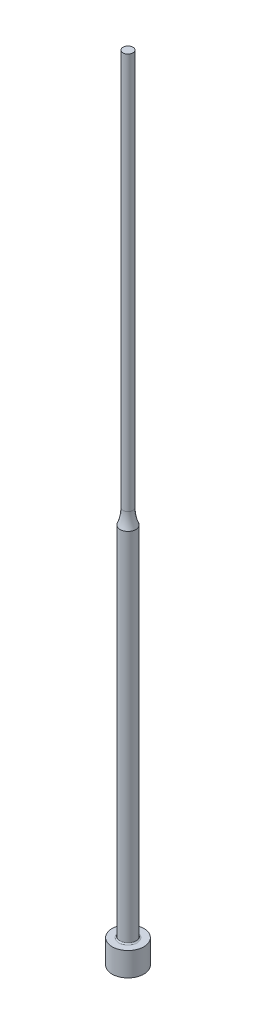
ISO-10303-21;
HEADER;
FILE_DESCRIPTION(('STEP AP214'),'2;1');
FILE_NAME('part.step','',(''),(''),'','','');
FILE_SCHEMA(('AUTOMOTIVE_DESIGN { 1 0 10303 214 1 1 1 1 }'));
ENDSEC;
DATA;
#1=APPLICATION_CONTEXT('core data for automotive mechanical design processes');
#2=APPLICATION_PROTOCOL_DEFINITION('international standard','automotive_design',2000,#1);
#3=PRODUCT_CONTEXT('',#1,'mechanical');
#4=PRODUCT('Part','Part','',(#3));
#5=PRODUCT_RELATED_PRODUCT_CATEGORY('part','',(#4));
#6=PRODUCT_DEFINITION_FORMATION('','',#4);
#7=PRODUCT_DEFINITION_CONTEXT('part definition',#1,'design');
#8=PRODUCT_DEFINITION('design','',#6,#7);
#9=PRODUCT_DEFINITION_SHAPE('','',#8);
#10=(LENGTH_UNIT() NAMED_UNIT(*) SI_UNIT(.MILLI.,.METRE.));
#11=(NAMED_UNIT(*) PLANE_ANGLE_UNIT() SI_UNIT($,.RADIAN.));
#12=(NAMED_UNIT(*) SI_UNIT($,.STERADIAN.) SOLID_ANGLE_UNIT());
#13=UNCERTAINTY_MEASURE_WITH_UNIT(LENGTH_MEASURE(1.E-05),#10,'distance_accuracy_value','');
#14=(GEOMETRIC_REPRESENTATION_CONTEXT(3) GLOBAL_UNCERTAINTY_ASSIGNED_CONTEXT((#13)) GLOBAL_UNIT_ASSIGNED_CONTEXT((#10,
#11,#12)) REPRESENTATION_CONTEXT('',''));
#15=CARTESIAN_POINT('',(0.,0.,0.));
#16=DIRECTION('',(0.,0.,1.));
#17=DIRECTION('',(1.,0.,0.));
#18=AXIS2_PLACEMENT_3D('',#15,#16,#17);
#19=CARTESIAN_POINT('',(1.25000000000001,200.,0.));
#20=DIRECTION('',(0.,-1.,0.));
#21=DIRECTION('',(1.,0.,0.));
#22=AXIS2_PLACEMENT_3D('',#19,#20,#21);
#23=PLANE('',#22);
#24=CARTESIAN_POINT('',(0.,200.,0.));
#25=DIRECTION('',(0.,1.,0.));
#26=DIRECTION('',(-1.,0.,0.));
#27=AXIS2_PLACEMENT_3D('',#24,#25,#26);
#28=CIRCLE('',#27,1.25000000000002);
#29=CARTESIAN_POINT('',(-1.25000000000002,200.,0.));
#30=VERTEX_POINT('',#29);
#31=EDGE_CURVE('E10',#30,#30,#28,.T.);
#32=ORIENTED_EDGE('',*,*,#31,.T.);
#33=EDGE_LOOP('',(#32));
#34=FACE_BOUND('',#33,.T.);
#35=ADVANCED_FACE('F30',(#34),#23,.F.);
#36=CARTESIAN_POINT('',(0.,200.,0.));
#37=DIRECTION('',(0.,1.,0.));
#38=DIRECTION('',(-1.,0.,0.));
#39=AXIS2_PLACEMENT_3D('',#36,#37,#38);
#40=CYLINDRICAL_SURFACE('',#39,1.25000000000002);
#41=ORIENTED_EDGE('',*,*,#31,.F.);
#42=EDGE_LOOP('',(#41));
#43=FACE_BOUND('',#42,.T.);
#44=CARTESIAN_POINT('',(0.,100.,0.));
#45=DIRECTION('',(0.,1.,0.));
#46=DIRECTION('',(-1.,0.,0.));
#47=AXIS2_PLACEMENT_3D('',#44,#45,#46);
#48=CIRCLE('',#47,1.25000000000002);
#49=CARTESIAN_POINT('',(-1.25000000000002,100.,0.));
#50=VERTEX_POINT('',#49);
#51=EDGE_CURVE('E36',#50,#50,#48,.T.);
#52=ORIENTED_EDGE('',*,*,#51,.T.);
#53=EDGE_LOOP('',(#52));
#54=FACE_BOUND('',#53,.T.);
#55=ADVANCED_FACE('F71',(#43,#54),#40,.T.);
#56=CARTESIAN_POINT('',(0.,100.,0.));
#57=DIRECTION('',(0.,1.,0.));
#58=DIRECTION('',(-1.,0.,0.));
#59=AXIS2_PLACEMENT_3D('',#56,#57,#58);
#60=TOROIDAL_SURFACE('',#59,11.25,10.);
#61=ORIENTED_EDGE('',*,*,#51,.F.);
#62=EDGE_LOOP('',(#61));
#63=FACE_BOUND('',#62,.T.);
#64=CARTESIAN_POINT('',(0.,96.2003289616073,0.));
#65=DIRECTION('',(0.,1.,0.));
#66=DIRECTION('',(-1.,0.,0.));
#67=AXIS2_PLACEMENT_3D('',#64,#65,#66);
#68=CIRCLE('',#67,2.00000000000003);
#69=CARTESIAN_POINT('',(-2.00000000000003,96.2003289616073,0.));
#70=VERTEX_POINT('',#69);
#71=EDGE_CURVE('E40',#70,#70,#68,.T.);
#72=ORIENTED_EDGE('',*,*,#71,.T.);
#73=EDGE_LOOP('',(#72));
#74=FACE_BOUND('',#73,.T.);
#75=ADVANCED_FACE('F75',(#63,#74),#60,.F.);
#76=CARTESIAN_POINT('',(0.,200.,0.));
#77=DIRECTION('',(0.,1.,0.));
#78=DIRECTION('',(-1.,0.,0.));
#79=AXIS2_PLACEMENT_3D('',#76,#77,#78);
#80=CYLINDRICAL_SURFACE('',#79,2.00000000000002);
#81=ORIENTED_EDGE('',*,*,#71,.F.);
#82=EDGE_LOOP('',(#81));
#83=FACE_BOUND('',#82,.T.);
#84=CARTESIAN_POINT('',(0.,6.3,0.));
#85=DIRECTION('',(0.,1.,0.));
#86=DIRECTION('',(-1.,0.,0.));
#87=AXIS2_PLACEMENT_3D('',#84,#85,#86);
#88=CIRCLE('',#87,2.00000000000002);
#89=CARTESIAN_POINT('',(-2.00000000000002,6.3,0.));
#90=VERTEX_POINT('',#89);
#91=EDGE_CURVE('E44',#90,#90,#88,.T.);
#92=ORIENTED_EDGE('',*,*,#91,.T.);
#93=EDGE_LOOP('',(#92));
#94=FACE_BOUND('',#93,.T.);
#95=ADVANCED_FACE('F80',(#83,#94),#80,.T.);
#96=CARTESIAN_POINT('',(0.,6.3,0.));
#97=DIRECTION('',(0.,1.,0.));
#98=DIRECTION('',(-1.,0.,0.));
#99=AXIS2_PLACEMENT_3D('',#96,#97,#98);
#100=TOROIDAL_SURFACE('',#99,2.30000000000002,0.3);
#101=ORIENTED_EDGE('',*,*,#91,.F.);
#102=EDGE_LOOP('',(#101));
#103=FACE_BOUND('',#102,.T.);
#104=CARTESIAN_POINT('',(0.,6.00000000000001,0.));
#105=DIRECTION('',(0.,1.,0.));
#106=DIRECTION('',(-1.,0.,0.));
#107=AXIS2_PLACEMENT_3D('',#104,#105,#106);
#108=CIRCLE('',#107,2.30000000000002);
#109=CARTESIAN_POINT('',(-2.30000000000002,6.00000000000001,0.));
#110=VERTEX_POINT('',#109);
#111=EDGE_CURVE('E49',#110,#110,#108,.T.);
#112=ORIENTED_EDGE('',*,*,#111,.T.);
#113=EDGE_LOOP('',(#112));
#114=FACE_BOUND('',#113,.T.);
#115=ADVANCED_FACE('F86',(#103,#114),#100,.F.);
#116=CARTESIAN_POINT('',(4.00000000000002,6.,0.));
#117=DIRECTION('',(0.,-1.,0.));
#118=DIRECTION('',(1.,0.,0.));
#119=AXIS2_PLACEMENT_3D('',#116,#117,#118);
#120=PLANE('',#119);
#121=ORIENTED_EDGE('',*,*,#111,.F.);
#122=EDGE_LOOP('',(#121));
#123=FACE_BOUND('',#122,.T.);
#124=CARTESIAN_POINT('',(0.,6.00000000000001,0.));
#125=DIRECTION('',(0.,1.,0.));
#126=DIRECTION('',(-1.,0.,0.));
#127=AXIS2_PLACEMENT_3D('',#124,#125,#126);
#128=CIRCLE('',#127,4.00000000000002);
#129=CARTESIAN_POINT('',(-4.00000000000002,6.00000000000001,0.));
#130=VERTEX_POINT('',#129);
#131=EDGE_CURVE('E52',#130,#130,#128,.T.);
#132=ORIENTED_EDGE('',*,*,#131,.T.);
#133=EDGE_LOOP('',(#132));
#134=FACE_BOUND('',#133,.T.);
#135=ADVANCED_FACE('F67',(#123,#134),#120,.F.);
#136=CARTESIAN_POINT('',(0.,200.,0.));
#137=DIRECTION('',(0.,1.,0.));
#138=DIRECTION('',(-1.,0.,0.));
#139=AXIS2_PLACEMENT_3D('',#136,#137,#138);
#140=CYLINDRICAL_SURFACE('',#139,4.00000000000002);
#141=ORIENTED_EDGE('',*,*,#131,.F.);
#142=EDGE_LOOP('',(#141));
#143=FACE_BOUND('',#142,.T.);
#144=CARTESIAN_POINT('',(0.,0.,0.));
#145=DIRECTION('',(0.,1.,0.));
#146=DIRECTION('',(-1.,0.,0.));
#147=AXIS2_PLACEMENT_3D('',#144,#145,#146);
#148=CIRCLE('',#147,4.00000000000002);
#149=CARTESIAN_POINT('',(-4.00000000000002,0.,0.));
#150=VERTEX_POINT('',#149);
#151=EDGE_CURVE('E55',#150,#150,#148,.T.);
#152=ORIENTED_EDGE('',*,*,#151,.T.);
#153=EDGE_LOOP('',(#152));
#154=FACE_BOUND('',#153,.T.);
#155=ADVANCED_FACE('F59',(#143,#154),#140,.T.);
#156=CARTESIAN_POINT('',(0.,0.,0.));
#157=DIRECTION('',(0.,1.,0.));
#158=DIRECTION('',(-1.,0.,0.));
#159=AXIS2_PLACEMENT_3D('',#156,#157,#158);
#160=PLANE('',#159);
#161=ORIENTED_EDGE('',*,*,#151,.F.);
#162=EDGE_LOOP('',(#161));
#163=FACE_BOUND('',#162,.T.);
#164=ADVANCED_FACE('F61',(#163),#160,.F.);
#165=CLOSED_SHELL('',(#35,#55,#75,#95,#115,#135,#155,#164));
#166=MANIFOLD_SOLID_BREP('B2',#165);
#167=ADVANCED_BREP_SHAPE_REPRESENTATION('',(#18,#166),#14);
#168=SHAPE_DEFINITION_REPRESENTATION(#9,#167);
ENDSEC;
END-ISO-10303-21;
